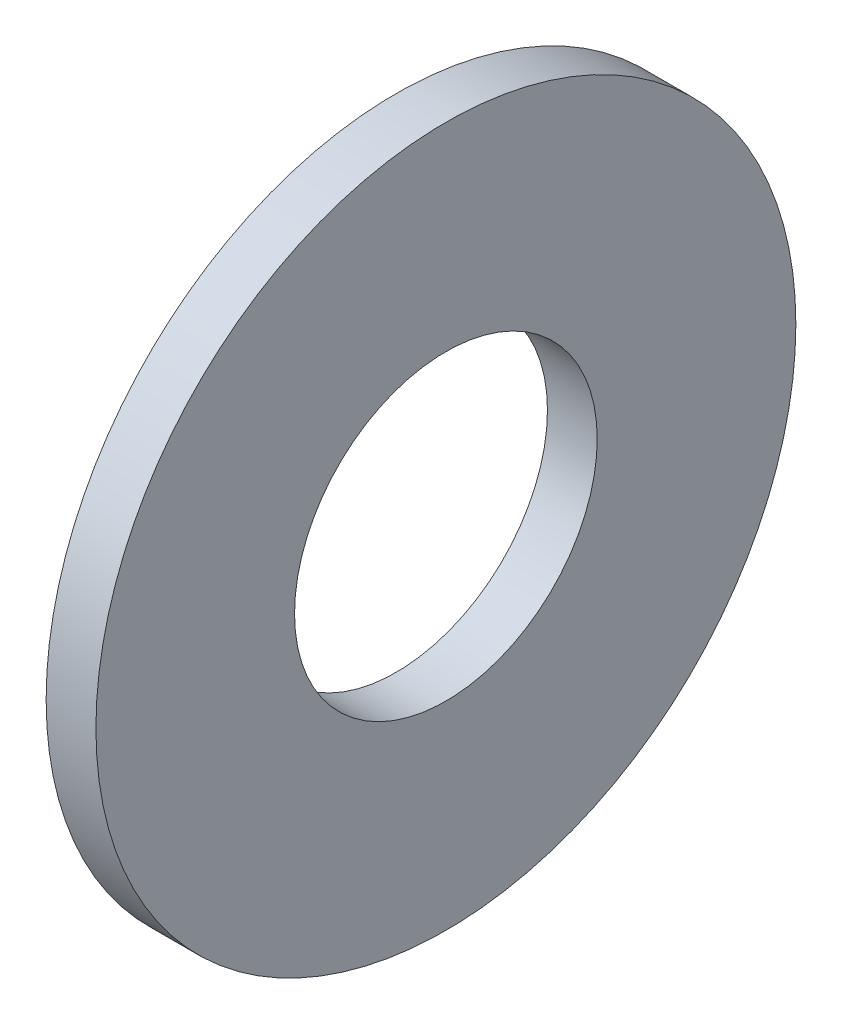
ISO-10303-21;
HEADER;
FILE_DESCRIPTION(('STEP AP214'),'2;1');
FILE_NAME('part.step','',(''),(''),'','','');
FILE_SCHEMA(('AUTOMOTIVE_DESIGN { 1 0 10303 214 1 1 1 1 }'));
ENDSEC;
DATA;
#1=APPLICATION_CONTEXT('core data for automotive mechanical design processes');
#2=APPLICATION_PROTOCOL_DEFINITION('international standard','automotive_design',2000,#1);
#3=PRODUCT_CONTEXT('',#1,'mechanical');
#4=PRODUCT('Part','Part','',(#3));
#5=PRODUCT_RELATED_PRODUCT_CATEGORY('part','',(#4));
#6=PRODUCT_DEFINITION_FORMATION('','',#4);
#7=PRODUCT_DEFINITION_CONTEXT('part definition',#1,'design');
#8=PRODUCT_DEFINITION('design','',#6,#7);
#9=PRODUCT_DEFINITION_SHAPE('','',#8);
#10=(LENGTH_UNIT() NAMED_UNIT(*) SI_UNIT(.MILLI.,.METRE.));
#11=(NAMED_UNIT(*) PLANE_ANGLE_UNIT() SI_UNIT($,.RADIAN.));
#12=(NAMED_UNIT(*) SI_UNIT($,.STERADIAN.) SOLID_ANGLE_UNIT());
#13=UNCERTAINTY_MEASURE_WITH_UNIT(LENGTH_MEASURE(1.E-05),#10,'distance_accuracy_value','');
#14=(GEOMETRIC_REPRESENTATION_CONTEXT(3) GLOBAL_UNCERTAINTY_ASSIGNED_CONTEXT((#13)) GLOBAL_UNIT_ASSIGNED_CONTEXT((#10,
#11,#12)) REPRESENTATION_CONTEXT('',''));
#15=CARTESIAN_POINT('',(0.,0.,0.));
#16=DIRECTION('',(0.,0.,1.));
#17=DIRECTION('',(1.,0.,0.));
#18=AXIS2_PLACEMENT_3D('',#15,#16,#17);
#19=CARTESIAN_POINT('',(-34.9249999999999,0.,0.));
#20=DIRECTION('',(-1.,0.,0.));
#21=DIRECTION('',(0.,0.,1.));
#22=AXIS2_PLACEMENT_3D('',#19,#20,#21);
#23=CYLINDRICAL_SURFACE('',#22,19.46);
#24=CARTESIAN_POINT('',(0.,0.,0.));
#25=DIRECTION('',(-1.,0.,0.));
#26=DIRECTION('',(0.,0.,1.));
#27=AXIS2_PLACEMENT_3D('',#24,#25,#26);
#28=CIRCLE('',#27,19.46);
#29=CARTESIAN_POINT('',(0.,0.,19.46));
#30=VERTEX_POINT('',#29);
#31=EDGE_CURVE('E10',#30,#30,#28,.T.);
#32=ORIENTED_EDGE('',*,*,#31,.F.);
#33=EDGE_LOOP('',(#32));
#34=FACE_BOUND('',#33,.T.);
#35=CARTESIAN_POINT('',(-6.4,0.,0.));
#36=DIRECTION('',(-1.,0.,0.));
#37=DIRECTION('',(0.,0.,1.));
#38=AXIS2_PLACEMENT_3D('',#35,#36,#37);
#39=CIRCLE('',#38,19.46);
#40=CARTESIAN_POINT('',(-6.4,0.,19.46));
#41=VERTEX_POINT('',#40);
#42=EDGE_CURVE('E45',#41,#41,#39,.T.);
#43=ORIENTED_EDGE('',*,*,#42,.T.);
#44=EDGE_LOOP('',(#43));
#45=FACE_BOUND('',#44,.T.);
#46=ADVANCED_FACE('F31',(#34,#45),#23,.F.);
#47=CARTESIAN_POINT('',(0.,19.46,0.));
#48=DIRECTION('',(-1.,0.,0.));
#49=DIRECTION('',(0.,0.,1.));
#50=AXIS2_PLACEMENT_3D('',#47,#48,#49);
#51=PLANE('',#50);
#52=CARTESIAN_POINT('',(0.,0.,0.));
#53=DIRECTION('',(-1.,0.,0.));
#54=DIRECTION('',(0.,0.,1.));
#55=AXIS2_PLACEMENT_3D('',#52,#53,#54);
#56=CIRCLE('',#55,45.);
#57=CARTESIAN_POINT('',(0.,0.,45.));
#58=VERTEX_POINT('',#57);
#59=EDGE_CURVE('E37',#58,#58,#56,.T.);
#60=ORIENTED_EDGE('',*,*,#59,.F.);
#61=EDGE_LOOP('',(#60));
#62=FACE_BOUND('',#61,.T.);
#63=ORIENTED_EDGE('',*,*,#31,.T.);
#64=EDGE_LOOP('',(#63));
#65=FACE_BOUND('',#64,.T.);
#66=ADVANCED_FACE('F60',(#62,#65),#51,.F.);
#67=CARTESIAN_POINT('',(-34.9249999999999,0.,0.));
#68=DIRECTION('',(-1.,0.,0.));
#69=DIRECTION('',(0.,0.,1.));
#70=AXIS2_PLACEMENT_3D('',#67,#68,#69);
#71=CYLINDRICAL_SURFACE('',#70,45.);
#72=CARTESIAN_POINT('',(-6.4,0.,0.));
#73=DIRECTION('',(-1.,0.,0.));
#74=DIRECTION('',(0.,0.,1.));
#75=AXIS2_PLACEMENT_3D('',#72,#73,#74);
#76=CIRCLE('',#75,45.);
#77=CARTESIAN_POINT('',(-6.4,0.,45.));
#78=VERTEX_POINT('',#77);
#79=EDGE_CURVE('E41',#78,#78,#76,.T.);
#80=ORIENTED_EDGE('',*,*,#79,.F.);
#81=EDGE_LOOP('',(#80));
#82=FACE_BOUND('',#81,.T.);
#83=ORIENTED_EDGE('',*,*,#59,.T.);
#84=EDGE_LOOP('',(#83));
#85=FACE_BOUND('',#84,.T.);
#86=ADVANCED_FACE('F55',(#82,#85),#71,.T.);
#87=CARTESIAN_POINT('',(-6.4,45.,0.));
#88=DIRECTION('',(1.,0.,0.));
#89=DIRECTION('',(0.,0.,-1.));
#90=AXIS2_PLACEMENT_3D('',#87,#88,#89);
#91=PLANE('',#90);
#92=ORIENTED_EDGE('',*,*,#42,.F.);
#93=EDGE_LOOP('',(#92));
#94=FACE_BOUND('',#93,.T.);
#95=ORIENTED_EDGE('',*,*,#79,.T.);
#96=EDGE_LOOP('',(#95));
#97=FACE_BOUND('',#96,.T.);
#98=ADVANCED_FACE('F52',(#94,#97),#91,.F.);
#99=CLOSED_SHELL('',(#46,#66,#86,#98));
#100=MANIFOLD_SOLID_BREP('B2',#99);
#101=ADVANCED_BREP_SHAPE_REPRESENTATION('',(#18,#100),#14);
#102=SHAPE_DEFINITION_REPRESENTATION(#9,#101);
ENDSEC;
END-ISO-10303-21;
